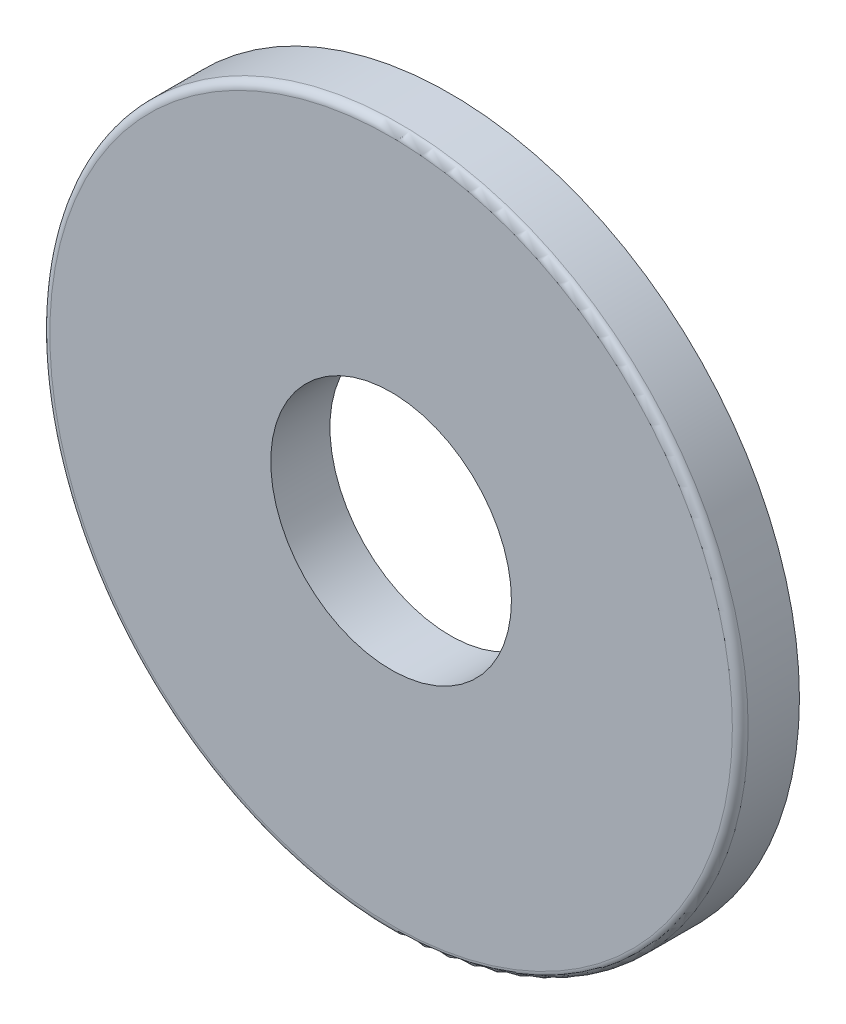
ISO-10303-21;
HEADER;
FILE_DESCRIPTION(('STEP AP214'),'2;1');
FILE_NAME('part.step','',(''),(''),'','','');
FILE_SCHEMA(('AUTOMOTIVE_DESIGN { 1 0 10303 214 1 1 1 1 }'));
ENDSEC;
DATA;
#1=APPLICATION_CONTEXT('core data for automotive mechanical design processes');
#2=APPLICATION_PROTOCOL_DEFINITION('international standard','automotive_design',2000,#1);
#3=PRODUCT_CONTEXT('',#1,'mechanical');
#4=PRODUCT('Part','Part','',(#3));
#5=PRODUCT_RELATED_PRODUCT_CATEGORY('part','',(#4));
#6=PRODUCT_DEFINITION_FORMATION('','',#4);
#7=PRODUCT_DEFINITION_CONTEXT('part definition',#1,'design');
#8=PRODUCT_DEFINITION('design','',#6,#7);
#9=PRODUCT_DEFINITION_SHAPE('','',#8);
#10=(LENGTH_UNIT() NAMED_UNIT(*) SI_UNIT(.MILLI.,.METRE.));
#11=(NAMED_UNIT(*) PLANE_ANGLE_UNIT() SI_UNIT($,.RADIAN.));
#12=(NAMED_UNIT(*) SI_UNIT($,.STERADIAN.) SOLID_ANGLE_UNIT());
#13=UNCERTAINTY_MEASURE_WITH_UNIT(LENGTH_MEASURE(1.E-05),#10,'distance_accuracy_value','');
#14=(GEOMETRIC_REPRESENTATION_CONTEXT(3) GLOBAL_UNCERTAINTY_ASSIGNED_CONTEXT((#13)) GLOBAL_UNIT_ASSIGNED_CONTEXT((#10,
#11,#12)) REPRESENTATION_CONTEXT('',''));
#15=CARTESIAN_POINT('',(0.,0.,0.));
#16=DIRECTION('',(0.,0.,1.));
#17=DIRECTION('',(1.,0.,0.));
#18=AXIS2_PLACEMENT_3D('',#15,#16,#17);
#19=CARTESIAN_POINT('',(0.,0.,0.));
#20=DIRECTION('',(0.,0.,1.));
#21=DIRECTION('',(1.,0.,0.));
#22=AXIS2_PLACEMENT_3D('',#19,#20,#21);
#23=PLANE('',#22);
#24=CARTESIAN_POINT('',(0.,0.,0.));
#25=DIRECTION('',(0.,0.,1.));
#26=DIRECTION('',(1.,0.,0.));
#27=AXIS2_PLACEMENT_3D('',#24,#25,#26);
#28=CIRCLE('',#27,8.85);
#29=CARTESIAN_POINT('',(8.85,0.,0.));
#30=VERTEX_POINT('',#29);
#31=EDGE_CURVE('E40',#30,#30,#28,.T.);
#32=ORIENTED_EDGE('',*,*,#31,.F.);
#33=EDGE_LOOP('',(#32));
#34=FACE_BOUND('',#33,.T.);
#35=CARTESIAN_POINT('',(0.,0.,0.));
#36=DIRECTION('',(0.,0.,1.));
#37=DIRECTION('',(1.,0.,0.));
#38=AXIS2_PLACEMENT_3D('',#35,#36,#37);
#39=CIRCLE('',#38,3.05);
#40=CARTESIAN_POINT('',(3.05,0.,0.));
#41=VERTEX_POINT('',#40);
#42=EDGE_CURVE('E49',#41,#41,#39,.T.);
#43=ORIENTED_EDGE('',*,*,#42,.T.);
#44=EDGE_LOOP('',(#43));
#45=FACE_BOUND('',#44,.T.);
#46=ADVANCED_FACE('F29',(#34,#45),#23,.F.);
#47=CARTESIAN_POINT('',(0.,0.,1.5));
#48=DIRECTION('',(0.,0.,1.));
#49=DIRECTION('',(1.,0.,0.));
#50=AXIS2_PLACEMENT_3D('',#47,#48,#49);
#51=PLANE('',#50);
#52=CARTESIAN_POINT('',(0.,0.,1.5));
#53=DIRECTION('',(0.,0.,1.));
#54=DIRECTION('',(1.,0.,0.));
#55=AXIS2_PLACEMENT_3D('',#52,#53,#54);
#56=CIRCLE('',#55,8.65);
#57=CARTESIAN_POINT('',(8.65,0.,1.5));
#58=VERTEX_POINT('',#57);
#59=EDGE_CURVE('E36',#58,#58,#56,.T.);
#60=ORIENTED_EDGE('',*,*,#59,.T.);
#61=EDGE_LOOP('',(#60));
#62=FACE_BOUND('',#61,.T.);
#63=CARTESIAN_POINT('',(0.,0.,1.5));
#64=DIRECTION('',(0.,0.,1.));
#65=DIRECTION('',(1.,0.,0.));
#66=AXIS2_PLACEMENT_3D('',#63,#64,#65);
#67=CIRCLE('',#66,3.05);
#68=CARTESIAN_POINT('',(3.05,0.,1.5));
#69=VERTEX_POINT('',#68);
#70=EDGE_CURVE('E44',#69,#69,#67,.T.);
#71=ORIENTED_EDGE('',*,*,#70,.F.);
#72=EDGE_LOOP('',(#71));
#73=FACE_BOUND('',#72,.T.);
#74=ADVANCED_FACE('F65',(#62,#73),#51,.T.);
#75=CARTESIAN_POINT('',(0.,0.,1.5));
#76=DIRECTION('',(0.,0.,-1.));
#77=DIRECTION('',(-1.,0.,0.));
#78=AXIS2_PLACEMENT_3D('',#75,#76,#77);
#79=CYLINDRICAL_SURFACE('',#78,8.85);
#80=CARTESIAN_POINT('',(0.,0.,1.3));
#81=DIRECTION('',(0.,0.,1.));
#82=DIRECTION('',(1.,0.,0.));
#83=AXIS2_PLACEMENT_3D('',#80,#81,#82);
#84=CIRCLE('',#83,8.85);
#85=CARTESIAN_POINT('',(8.85,0.,1.3));
#86=VERTEX_POINT('',#85);
#87=EDGE_CURVE('E10',#86,#86,#84,.F.);
#88=ORIENTED_EDGE('',*,*,#87,.T.);
#89=EDGE_LOOP('',(#88));
#90=FACE_BOUND('',#89,.T.);
#91=ORIENTED_EDGE('',*,*,#31,.T.);
#92=EDGE_LOOP('',(#91));
#93=FACE_BOUND('',#92,.T.);
#94=ADVANCED_FACE('F31',(#90,#93),#79,.T.);
#95=CARTESIAN_POINT('',(0.,0.,1.5));
#96=DIRECTION('',(0.,0.,-1.));
#97=DIRECTION('',(-1.,0.,0.));
#98=AXIS2_PLACEMENT_3D('',#95,#96,#97);
#99=CYLINDRICAL_SURFACE('',#98,3.05);
#100=ORIENTED_EDGE('',*,*,#70,.T.);
#101=EDGE_LOOP('',(#100));
#102=FACE_BOUND('',#101,.T.);
#103=ORIENTED_EDGE('',*,*,#42,.F.);
#104=EDGE_LOOP('',(#103));
#105=FACE_BOUND('',#104,.T.);
#106=ADVANCED_FACE('F54',(#102,#105),#99,.F.);
#107=CARTESIAN_POINT('',(0.,0.,1.3));
#108=DIRECTION('',(0.,0.,1.));
#109=DIRECTION('',(1.,0.,0.));
#110=AXIS2_PLACEMENT_3D('',#107,#108,#109);
#111=TOROIDAL_SURFACE('',#110,8.65,0.2);
#112=ORIENTED_EDGE('',*,*,#87,.F.);
#113=EDGE_LOOP('',(#112));
#114=FACE_BOUND('',#113,.T.);
#115=ORIENTED_EDGE('',*,*,#59,.F.);
#116=EDGE_LOOP('',(#115));
#117=FACE_BOUND('',#116,.T.);
#118=ADVANCED_FACE('F56',(#114,#117),#111,.T.);
#119=CLOSED_SHELL('',(#46,#74,#94,#106,#118));
#120=MANIFOLD_SOLID_BREP('B2',#119);
#121=ADVANCED_BREP_SHAPE_REPRESENTATION('',(#18,#120),#14);
#122=SHAPE_DEFINITION_REPRESENTATION(#9,#121);
ENDSEC;
END-ISO-10303-21;
